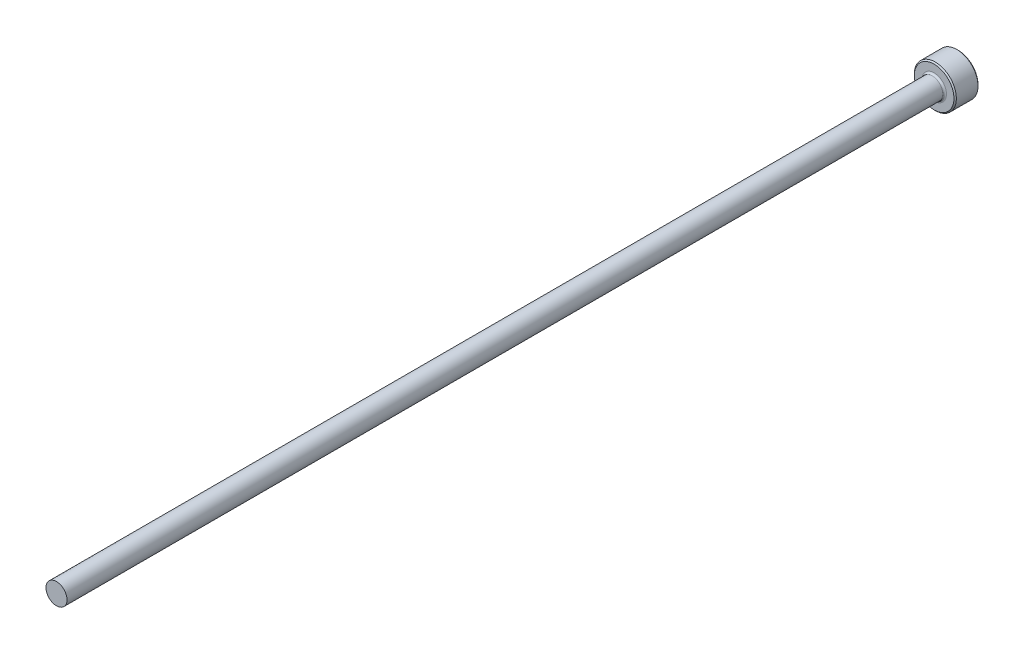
from build123d import *

# Parameters (mm, degrees)
CHAMFER1_SIZE = 0.2


with BuildPart() as part:
    # Sketch1 → Revolve1 (revolve)
    with BuildSketch(Plane(origin=(0, 0, 0), x_dir=(0, 0, -1), z_dir=(1, 0, 0)), mode=Mode.PRIVATE) as revolve1_sk:
        with BuildLine():
            Line((0, 0), (0, 3.5))
            Line((0, 3.5), (-4, 3.5))
            Line((-4, 3.5), (-4, 2.05))
            ThreePointArc((-4, 2.05), (-4.087867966, 1.837867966), (-4.3, 1.75))
            Line((-4.3, 1.75), (-150, 1.75))
            Line((-150, 1.75), (-150, 0))
            Line((-150, 0), (0, 0))
        make_face()
    revolve(revolve1_sk.sketch.rotate(Axis((0, 0, 109.05062828), (0, 0, -1)), 90), axis=Axis((0, 0, 109.05062828), (0, 0, -1)))

    # Chamfer1
    chamfer1_edges = [part.edges().sort_by_distance(p)[0] for p in [
        (-3.5, 0, 0),
        (-3.5, 0, 4),
    ]]
    chamfer(chamfer1_edges, length=CHAMFER1_SIZE)


solid = part.part
